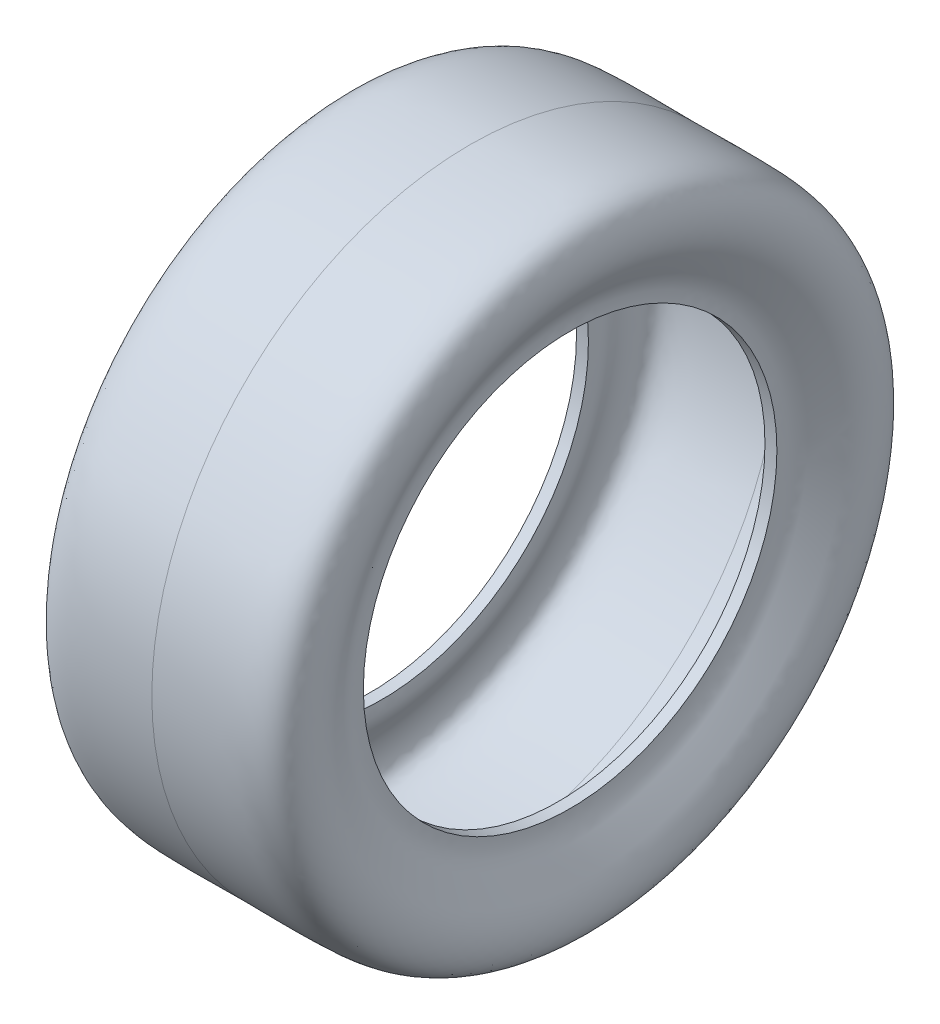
ISO-10303-21;
HEADER;
FILE_DESCRIPTION(('STEP AP214'),'2;1');
FILE_NAME('part.step','',(''),(''),'','','');
FILE_SCHEMA(('AUTOMOTIVE_DESIGN { 1 0 10303 214 1 1 1 1 }'));
ENDSEC;
DATA;
#1=APPLICATION_CONTEXT('core data for automotive mechanical design processes');
#2=APPLICATION_PROTOCOL_DEFINITION('international standard','automotive_design',2000,#1);
#3=PRODUCT_CONTEXT('',#1,'mechanical');
#4=PRODUCT('Part','Part','',(#3));
#5=PRODUCT_RELATED_PRODUCT_CATEGORY('part','',(#4));
#6=PRODUCT_DEFINITION_FORMATION('','',#4);
#7=PRODUCT_DEFINITION_CONTEXT('part definition',#1,'design');
#8=PRODUCT_DEFINITION('design','',#6,#7);
#9=PRODUCT_DEFINITION_SHAPE('','',#8);
#10=(LENGTH_UNIT() NAMED_UNIT(*) SI_UNIT(.MILLI.,.METRE.));
#11=(NAMED_UNIT(*) PLANE_ANGLE_UNIT() SI_UNIT($,.RADIAN.));
#12=(NAMED_UNIT(*) SI_UNIT($,.STERADIAN.) SOLID_ANGLE_UNIT());
#13=UNCERTAINTY_MEASURE_WITH_UNIT(LENGTH_MEASURE(1.E-05),#10,'distance_accuracy_value','');
#14=(GEOMETRIC_REPRESENTATION_CONTEXT(3) GLOBAL_UNCERTAINTY_ASSIGNED_CONTEXT((#13)) GLOBAL_UNIT_ASSIGNED_CONTEXT((#10,
#11,#12)) REPRESENTATION_CONTEXT('',''));
#15=CARTESIAN_POINT('',(0.,0.,0.));
#16=DIRECTION('',(0.,0.,1.));
#17=DIRECTION('',(1.,0.,0.));
#18=AXIS2_PLACEMENT_3D('',#15,#16,#17);
#19=CARTESIAN_POINT('',(0.,254.,0.));
#20=CARTESIAN_POINT('',(-17.7301497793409,254.190825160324,0.));
#21=CARTESIAN_POINT('',(-48.115981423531,254.517860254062,0.));
#22=CARTESIAN_POINT('',(-100.142439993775,252.674826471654,0.));
#23=CARTESIAN_POINT('',(-103.840153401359,203.871788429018,0.));
#24=CARTESIAN_POINT('',(-79.0427188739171,184.345181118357,0.));
#25=CARTESIAN_POINT('',(-79.8747524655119,167.790906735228,0.));
#26=CARTESIAN_POINT('',(-80.01,165.1,0.));
#27=B_SPLINE_CURVE_WITH_KNOTS('',3,(#19,#20,#21,#22,#23,#24,#25,#26),.UNSPECIFIED.,.F.,.F.,(4,1,
1,1,1,4),(0.,0.311889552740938,0.534514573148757,0.727366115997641,0.95568320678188,1.),.UNSPECIFIED.);
#28=CARTESIAN_POINT('',(251.60561848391,0.,0.));
#29=DIRECTION('',(1.,0.,0.));
#30=AXIS1_PLACEMENT('',#28,#29);
#31=SURFACE_OF_REVOLUTION('',#27,#30);
#32=CARTESIAN_POINT('',(-80.01,0.,0.));
#33=DIRECTION('',(1.,0.,0.));
#34=DIRECTION('',(0.,0.,-1.));
#35=AXIS2_PLACEMENT_3D('',#32,#33,#34);
#36=CIRCLE('',#35,165.1);
#37=CARTESIAN_POINT('',(-80.01,0.,-165.1));
#38=VERTEX_POINT('',#37);
#39=EDGE_CURVE('E57',#38,#38,#36,.T.);
#40=ORIENTED_EDGE('',*,*,#39,.T.);
#41=EDGE_LOOP('',(#40));
#42=FACE_BOUND('',#41,.T.);
#43=CARTESIAN_POINT('',(0.,0.,0.));
#44=DIRECTION('',(1.,0.,0.));
#45=DIRECTION('',(0.,0.,-1.));
#46=AXIS2_PLACEMENT_3D('',#43,#44,#45);
#47=CIRCLE('',#46,254.);
#48=CARTESIAN_POINT('',(0.,0.,-254.));
#49=VERTEX_POINT('',#48);
#50=EDGE_CURVE('E10',#49,#49,#47,.T.);
#51=ORIENTED_EDGE('',*,*,#50,.F.);
#52=EDGE_LOOP('',(#51));
#53=FACE_BOUND('',#52,.T.);
#54=ADVANCED_FACE('F34',(#42,#53),#31,.F.);
#55=CARTESIAN_POINT('',(80.01,165.1,0.));
#56=CARTESIAN_POINT('',(79.8747524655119,167.790906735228,0.));
#57=CARTESIAN_POINT('',(79.0427188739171,184.345181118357,0.));
#58=CARTESIAN_POINT('',(103.840153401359,203.871788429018,0.));
#59=CARTESIAN_POINT('',(100.142439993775,252.674826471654,0.));
#60=CARTESIAN_POINT('',(48.1159814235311,254.517860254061,0.));
#61=CARTESIAN_POINT('',(17.7301497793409,254.190825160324,0.));
#62=CARTESIAN_POINT('',(0.,254.,0.));
#63=B_SPLINE_CURVE_WITH_KNOTS('',3,(#55,#56,#57,#58,#59,#60,#61,#62),.UNSPECIFIED.,.F.,.F.,(4,1,
1,1,1,4),(0.,0.0443167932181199,0.272633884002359,0.465485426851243,0.688110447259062,1.),.UNSPECIFIED.);
#64=CARTESIAN_POINT('',(251.60561848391,0.,0.));
#65=DIRECTION('',(1.,0.,0.));
#66=AXIS1_PLACEMENT('',#64,#65);
#67=SURFACE_OF_REVOLUTION('',#63,#66);
#68=ORIENTED_EDGE('',*,*,#50,.T.);
#69=EDGE_LOOP('',(#68));
#70=FACE_BOUND('',#69,.T.);
#71=CARTESIAN_POINT('',(80.01,0.,0.));
#72=DIRECTION('',(1.,0.,0.));
#73=DIRECTION('',(0.,0.,-1.));
#74=AXIS2_PLACEMENT_3D('',#71,#72,#73);
#75=CIRCLE('',#74,165.1);
#76=CARTESIAN_POINT('',(80.01,0.,-165.1));
#77=VERTEX_POINT('',#76);
#78=EDGE_CURVE('E41',#77,#77,#75,.T.);
#79=ORIENTED_EDGE('',*,*,#78,.F.);
#80=EDGE_LOOP('',(#79));
#81=FACE_BOUND('',#80,.T.);
#82=ADVANCED_FACE('F71',(#70,#81),#67,.F.);
#83=CARTESIAN_POINT('',(251.60561848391,0.,0.));
#84=DIRECTION('',(1.,0.,0.));
#85=DIRECTION('',(0.,0.,-1.));
#86=AXIS2_PLACEMENT_3D('',#83,#84,#85);
#87=CYLINDRICAL_SURFACE('',#86,165.1);
#88=ORIENTED_EDGE('',*,*,#78,.T.);
#89=EDGE_LOOP('',(#88));
#90=FACE_BOUND('',#89,.T.);
#91=CARTESIAN_POINT('',(70.485,0.,0.));
#92=DIRECTION('',(1.,0.,0.));
#93=DIRECTION('',(0.,0.,-1.));
#94=AXIS2_PLACEMENT_3D('',#91,#92,#93);
#95=CIRCLE('',#94,165.1);
#96=CARTESIAN_POINT('',(70.485,0.,-165.1));
#97=VERTEX_POINT('',#96);
#98=EDGE_CURVE('E45',#97,#97,#95,.T.);
#99=ORIENTED_EDGE('',*,*,#98,.F.);
#100=EDGE_LOOP('',(#99));
#101=FACE_BOUND('',#100,.T.);
#102=ADVANCED_FACE('F74',(#90,#101),#87,.F.);
#103=CARTESIAN_POINT('',(0.,247.65,0.));
#104=CARTESIAN_POINT('',(16.3417991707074,248.02073690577,0.));
#105=CARTESIAN_POINT('',(44.8612108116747,248.667740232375,0.));
#106=CARTESIAN_POINT('',(98.3370124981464,247.707159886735,0.));
#107=CARTESIAN_POINT('',(90.3312289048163,202.388341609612,0.));
#108=CARTESIAN_POINT('',(69.6182139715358,184.352091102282,0.));
#109=CARTESIAN_POINT('',(70.3638039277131,167.791872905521,0.));
#110=CARTESIAN_POINT('',(70.485,165.1,0.));
#111=B_SPLINE_CURVE_WITH_KNOTS('',3,(#103,#104,#105,#106,#107,#108,#109,#110),.UNSPECIFIED.,.F.,
.F.,(4,1,1,1,1,4),(0.,0.311512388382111,0.543645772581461,0.713253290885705,0.953389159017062,
1.),.UNSPECIFIED.);
#112=CARTESIAN_POINT('',(251.60561848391,0.,0.));
#113=DIRECTION('',(1.,0.,0.));
#114=AXIS1_PLACEMENT('',#112,#113);
#115=SURFACE_OF_REVOLUTION('',#111,#114);
#116=ORIENTED_EDGE('',*,*,#98,.T.);
#117=EDGE_LOOP('',(#116));
#118=FACE_BOUND('',#117,.T.);
#119=CARTESIAN_POINT('',(0.,0.,0.));
#120=DIRECTION('',(1.,0.,0.));
#121=DIRECTION('',(0.,0.,-1.));
#122=AXIS2_PLACEMENT_3D('',#119,#120,#121);
#123=CIRCLE('',#122,247.65);
#124=CARTESIAN_POINT('',(0.,0.,-247.65));
#125=VERTEX_POINT('',#124);
#126=EDGE_CURVE('E49',#125,#125,#123,.T.);
#127=ORIENTED_EDGE('',*,*,#126,.F.);
#128=EDGE_LOOP('',(#127));
#129=FACE_BOUND('',#128,.T.);
#130=ADVANCED_FACE('F77',(#118,#129),#115,.F.);
#131=CARTESIAN_POINT('',(-70.485,165.1,0.));
#132=CARTESIAN_POINT('',(-70.3638039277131,167.791872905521,0.));
#133=CARTESIAN_POINT('',(-69.6182139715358,184.352091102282,0.));
#134=CARTESIAN_POINT('',(-90.3312289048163,202.388341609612,0.));
#135=CARTESIAN_POINT('',(-98.3370124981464,247.707159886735,0.));
#136=CARTESIAN_POINT('',(-44.8612108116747,248.667740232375,0.));
#137=CARTESIAN_POINT('',(-16.3417991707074,248.02073690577,0.));
#138=CARTESIAN_POINT('',(0.,247.65,0.));
#139=B_SPLINE_CURVE_WITH_KNOTS('',3,(#131,#132,#133,#134,#135,#136,#137,#138),.UNSPECIFIED.,.F.,
.F.,(4,1,1,1,1,4),(0.,0.0466108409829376,0.286746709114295,0.456354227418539,0.68848761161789,
1.),.UNSPECIFIED.);
#140=CARTESIAN_POINT('',(251.60561848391,0.,0.));
#141=DIRECTION('',(1.,0.,0.));
#142=AXIS1_PLACEMENT('',#140,#141);
#143=SURFACE_OF_REVOLUTION('',#139,#142);
#144=ORIENTED_EDGE('',*,*,#126,.T.);
#145=EDGE_LOOP('',(#144));
#146=FACE_BOUND('',#145,.T.);
#147=CARTESIAN_POINT('',(-70.485,0.,0.));
#148=DIRECTION('',(1.,0.,0.));
#149=DIRECTION('',(0.,0.,-1.));
#150=AXIS2_PLACEMENT_3D('',#147,#148,#149);
#151=CIRCLE('',#150,165.1);
#152=CARTESIAN_POINT('',(-70.485,0.,-165.1));
#153=VERTEX_POINT('',#152);
#154=EDGE_CURVE('E54',#153,#153,#151,.T.);
#155=ORIENTED_EDGE('',*,*,#154,.F.);
#156=EDGE_LOOP('',(#155));
#157=FACE_BOUND('',#156,.T.);
#158=ADVANCED_FACE('F80',(#146,#157),#143,.F.);
#159=CARTESIAN_POINT('',(251.60561848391,0.,0.));
#160=DIRECTION('',(1.,0.,0.));
#161=DIRECTION('',(0.,0.,-1.));
#162=AXIS2_PLACEMENT_3D('',#159,#160,#161);
#163=CYLINDRICAL_SURFACE('',#162,165.1);
#164=ORIENTED_EDGE('',*,*,#154,.T.);
#165=EDGE_LOOP('',(#164));
#166=FACE_BOUND('',#165,.T.);
#167=ORIENTED_EDGE('',*,*,#39,.F.);
#168=EDGE_LOOP('',(#167));
#169=FACE_BOUND('',#168,.T.);
#170=ADVANCED_FACE('F84',(#166,#169),#163,.F.);
#171=CLOSED_SHELL('',(#54,#82,#102,#130,#158,#170));
#172=MANIFOLD_SOLID_BREP('B2',#171);
#173=ADVANCED_BREP_SHAPE_REPRESENTATION('',(#18,#172),#14);
#174=SHAPE_DEFINITION_REPRESENTATION(#9,#173);
ENDSEC;
END-ISO-10303-21;
